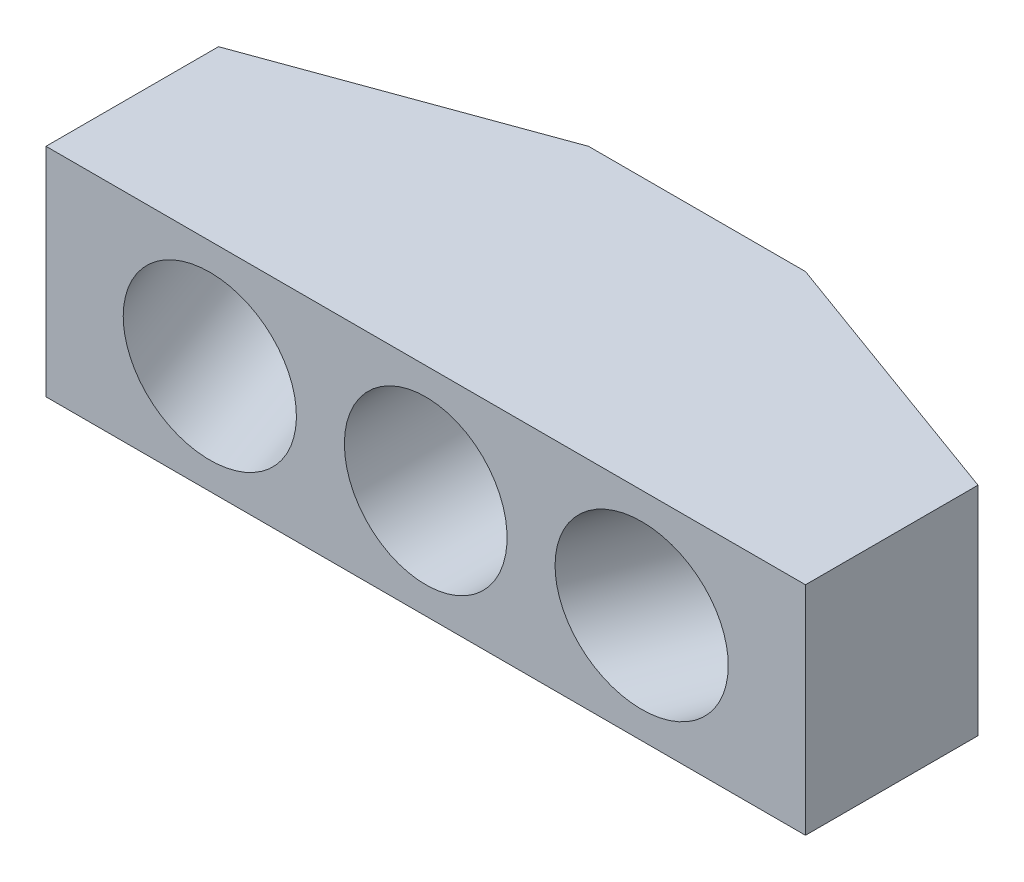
ISO-10303-21;
HEADER;
FILE_DESCRIPTION(('STEP AP214'),'2;1');
FILE_NAME('part.step','',(''),(''),'','','');
FILE_SCHEMA(('AUTOMOTIVE_DESIGN { 1 0 10303 214 1 1 1 1 }'));
ENDSEC;
DATA;
#1=APPLICATION_CONTEXT('core data for automotive mechanical design processes');
#2=APPLICATION_PROTOCOL_DEFINITION('international standard','automotive_design',2000,#1);
#3=PRODUCT_CONTEXT('',#1,'mechanical');
#4=PRODUCT('Part','Part','',(#3));
#5=PRODUCT_RELATED_PRODUCT_CATEGORY('part','',(#4));
#6=PRODUCT_DEFINITION_FORMATION('','',#4);
#7=PRODUCT_DEFINITION_CONTEXT('part definition',#1,'design');
#8=PRODUCT_DEFINITION('design','',#6,#7);
#9=PRODUCT_DEFINITION_SHAPE('','',#8);
#10=(LENGTH_UNIT() NAMED_UNIT(*) SI_UNIT(.MILLI.,.METRE.));
#11=(NAMED_UNIT(*) PLANE_ANGLE_UNIT() SI_UNIT($,.RADIAN.));
#12=(NAMED_UNIT(*) SI_UNIT($,.STERADIAN.) SOLID_ANGLE_UNIT());
#13=UNCERTAINTY_MEASURE_WITH_UNIT(LENGTH_MEASURE(1.E-05),#10,'distance_accuracy_value','');
#14=(GEOMETRIC_REPRESENTATION_CONTEXT(3) GLOBAL_UNCERTAINTY_ASSIGNED_CONTEXT((#13)) GLOBAL_UNIT_ASSIGNED_CONTEXT((#10,
#11,#12)) REPRESENTATION_CONTEXT('',''));
#15=CARTESIAN_POINT('',(0.,0.,0.));
#16=DIRECTION('',(0.,0.,1.));
#17=DIRECTION('',(1.,0.,0.));
#18=AXIS2_PLACEMENT_3D('',#15,#16,#17);
#19=CARTESIAN_POINT('',(4.,4.,-10.));
#20=DIRECTION('',(-0.342020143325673,0.,0.939692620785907));
#21=DIRECTION('',(0.939692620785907,0.,0.342020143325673));
#22=AXIS2_PLACEMENT_3D('',#19,#20,#21);
#23=PLANE('',#22);
#24=CARTESIAN_POINT('',(10.7110758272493,0.,-7.55736815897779));
#25=DIRECTION('',(-0.342020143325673,0.,0.939692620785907));
#26=DIRECTION('',(0.939692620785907,0.,0.342020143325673));
#27=AXIS2_PLACEMENT_3D('',#24,#25,#26);
#28=CIRCLE('',#27,3.22499999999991);
#29=CARTESIAN_POINT('',(13.7415845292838,0.,-6.45435319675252));
#30=VERTEX_POINT('',#29);
#31=EDGE_CURVE('E11',#30,#30,#28,.T.);
#32=ORIENTED_EDGE('',*,*,#31,.T.);
#33=EDGE_LOOP('',(#32));
#34=FACE_BOUND('',#33,.T.);
#35=DIRECTION('',(-0.939692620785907,0.,-0.342020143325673));
#36=VECTOR('',#35,1.);
#37=CARTESIAN_POINT('',(4.,-4.,-10.));
#38=LINE('',#37,#36);
#39=CARTESIAN_POINT('',(14.,-4.,-6.36029765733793));
#40=VERTEX_POINT('',#39);
#41=CARTESIAN_POINT('',(4.,-4.,-10.));
#42=VERTEX_POINT('',#41);
#43=EDGE_CURVE('E97',#40,#42,#38,.T.);
#44=ORIENTED_EDGE('',*,*,#43,.T.);
#45=DIRECTION('',(0.,-1.,0.));
#46=VECTOR('',#45,1.);
#47=CARTESIAN_POINT('',(4.,4.,-10.));
#48=LINE('',#47,#46);
#49=CARTESIAN_POINT('',(4.,4.,-10.));
#50=VERTEX_POINT('',#49);
#51=EDGE_CURVE('E153',#50,#42,#48,.T.);
#52=ORIENTED_EDGE('',*,*,#51,.F.);
#53=DIRECTION('',(-0.939692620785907,0.,-0.342020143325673));
#54=VECTOR('',#53,1.);
#55=CARTESIAN_POINT('',(9.41587104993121,4.,-8.02878414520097));
#56=LINE('',#55,#54);
#57=CARTESIAN_POINT('',(14.,4.,-6.36029765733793));
#58=VERTEX_POINT('',#57);
#59=EDGE_CURVE('E103',#58,#50,#56,.T.);
#60=ORIENTED_EDGE('',*,*,#59,.F.);
#61=DIRECTION('',(0.,-1.,0.));
#62=VECTOR('',#61,1.);
#63=CARTESIAN_POINT('',(14.,4.,-6.36029765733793));
#64=LINE('',#63,#62);
#65=EDGE_CURVE('E131',#58,#40,#64,.T.);
#66=ORIENTED_EDGE('',*,*,#65,.T.);
#67=EDGE_LOOP('',(#44,#52,#60,#66));
#68=FACE_BOUND('',#67,.T.);
#69=ADVANCED_FACE('F49',(#34,#68),#23,.F.);
#70=CARTESIAN_POINT('',(-4.,4.,-10.));
#71=DIRECTION('',(0.,0.,1.));
#72=DIRECTION('',(1.,0.,0.));
#73=AXIS2_PLACEMENT_3D('',#70,#71,#72);
#74=PLANE('',#73);
#75=CARTESIAN_POINT('',(0.,0.,-10.));
#76=DIRECTION('',(0.,0.,1.));
#77=DIRECTION('',(1.,0.,0.));
#78=AXIS2_PLACEMENT_3D('',#75,#76,#77);
#79=CIRCLE('',#78,3.225);
#80=CARTESIAN_POINT('',(3.225,0.,-10.));
#81=VERTEX_POINT('',#80);
#82=EDGE_CURVE('E171',#81,#81,#79,.T.);
#83=ORIENTED_EDGE('',*,*,#82,.T.);
#84=EDGE_LOOP('',(#83));
#85=FACE_BOUND('',#84,.T.);
#86=DIRECTION('',(-1.,0.,0.));
#87=VECTOR('',#86,1.);
#88=CARTESIAN_POINT('',(-4.,-4.,-10.));
#89=LINE('',#88,#87);
#90=CARTESIAN_POINT('',(-4.,-4.,-10.));
#91=VERTEX_POINT('',#90);
#92=EDGE_CURVE('E136',#42,#91,#89,.T.);
#93=ORIENTED_EDGE('',*,*,#92,.T.);
#94=DIRECTION('',(0.,-1.,0.));
#95=VECTOR('',#94,1.);
#96=CARTESIAN_POINT('',(-4.,4.,-10.));
#97=LINE('',#96,#95);
#98=CARTESIAN_POINT('',(-4.,4.,-10.));
#99=VERTEX_POINT('',#98);
#100=EDGE_CURVE('E150',#99,#91,#97,.T.);
#101=ORIENTED_EDGE('',*,*,#100,.F.);
#102=DIRECTION('',(-1.,0.,0.));
#103=VECTOR('',#102,1.);
#104=CARTESIAN_POINT('',(-4.,4.,-10.));
#105=LINE('',#104,#103);
#106=EDGE_CURVE('E236',#50,#99,#105,.T.);
#107=ORIENTED_EDGE('',*,*,#106,.F.);
#108=ORIENTED_EDGE('',*,*,#51,.T.);
#109=EDGE_LOOP('',(#93,#101,#107,#108));
#110=FACE_BOUND('',#109,.T.);
#111=ADVANCED_FACE('F189',(#85,#110),#74,.F.);
#112=CARTESIAN_POINT('',(-9.41587104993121,4.,-8.02878414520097));
#113=DIRECTION('',(0.342020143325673,0.,0.939692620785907));
#114=DIRECTION('',(0.939692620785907,0.,-0.342020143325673));
#115=AXIS2_PLACEMENT_3D('',#112,#113,#114);
#116=PLANE('',#115);
#117=CARTESIAN_POINT('',(-10.7110758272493,0.,-7.55736815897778));
#118=DIRECTION('',(0.342020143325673,0.,0.939692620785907));
#119=DIRECTION('',(0.939692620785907,0.,-0.342020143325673));
#120=AXIS2_PLACEMENT_3D('',#117,#118,#119);
#121=CIRCLE('',#120,3.09319805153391);
#122=CARTESIAN_POINT('',(-7.80442044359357,0.,-8.6153041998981));
#123=VERTEX_POINT('',#122);
#124=EDGE_CURVE('E165',#123,#123,#121,.T.);
#125=ORIENTED_EDGE('',*,*,#124,.T.);
#126=EDGE_LOOP('',(#125));
#127=FACE_BOUND('',#126,.T.);
#128=DIRECTION('',(-0.939692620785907,0.,0.342020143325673));
#129=VECTOR('',#128,1.);
#130=CARTESIAN_POINT('',(-9.41587104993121,-4.,-8.02878414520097));
#131=LINE('',#130,#129);
#132=CARTESIAN_POINT('',(-14.,-4.,-6.36029765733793));
#133=VERTEX_POINT('',#132);
#134=EDGE_CURVE('E140',#91,#133,#131,.T.);
#135=ORIENTED_EDGE('',*,*,#134,.T.);
#136=DIRECTION('',(0.,-1.,0.));
#137=VECTOR('',#136,1.);
#138=CARTESIAN_POINT('',(-14.,4.,-6.36029765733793));
#139=LINE('',#138,#137);
#140=CARTESIAN_POINT('',(-14.,4.,-6.36029765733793));
#141=VERTEX_POINT('',#140);
#142=EDGE_CURVE('E126',#141,#133,#139,.T.);
#143=ORIENTED_EDGE('',*,*,#142,.F.);
#144=DIRECTION('',(-0.939692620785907,0.,0.342020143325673));
#145=VECTOR('',#144,1.);
#146=CARTESIAN_POINT('',(-4.,4.,-10.));
#147=LINE('',#146,#145);
#148=EDGE_CURVE('E117',#99,#141,#147,.T.);
#149=ORIENTED_EDGE('',*,*,#148,.F.);
#150=ORIENTED_EDGE('',*,*,#100,.T.);
#151=EDGE_LOOP('',(#135,#143,#149,#150));
#152=FACE_BOUND('',#151,.T.);
#153=ADVANCED_FACE('F196',(#127,#152),#116,.F.);
#154=CARTESIAN_POINT('',(-14.,4.,0.));
#155=DIRECTION('',(1.,0.,0.));
#156=DIRECTION('',(0.,0.,-1.));
#157=AXIS2_PLACEMENT_3D('',#154,#155,#156);
#158=PLANE('',#157);
#159=DIRECTION('',(0.,0.,1.));
#160=VECTOR('',#159,1.);
#161=CARTESIAN_POINT('',(-14.,-4.,0.));
#162=LINE('',#161,#160);
#163=CARTESIAN_POINT('',(-14.,-4.,0.));
#164=VERTEX_POINT('',#163);
#165=EDGE_CURVE('E125',#133,#164,#162,.T.);
#166=ORIENTED_EDGE('',*,*,#165,.T.);
#167=DIRECTION('',(0.,-1.,0.));
#168=VECTOR('',#167,1.);
#169=CARTESIAN_POINT('',(-14.,4.,0.));
#170=LINE('',#169,#168);
#171=CARTESIAN_POINT('',(-14.,4.,0.));
#172=VERTEX_POINT('',#171);
#173=EDGE_CURVE('E122',#172,#164,#170,.T.);
#174=ORIENTED_EDGE('',*,*,#173,.F.);
#175=DIRECTION('',(0.,0.,1.));
#176=VECTOR('',#175,1.);
#177=CARTESIAN_POINT('',(-14.,4.,0.));
#178=LINE('',#177,#176);
#179=EDGE_CURVE('E111',#141,#172,#178,.T.);
#180=ORIENTED_EDGE('',*,*,#179,.F.);
#181=ORIENTED_EDGE('',*,*,#142,.T.);
#182=EDGE_LOOP('',(#166,#174,#180,#181));
#183=FACE_BOUND('',#182,.T.);
#184=ADVANCED_FACE('F123',(#183),#158,.F.);
#185=CARTESIAN_POINT('',(-14.,4.,0.));
#186=DIRECTION('',(0.,0.,-1.));
#187=DIRECTION('',(-1.,0.,0.));
#188=AXIS2_PLACEMENT_3D('',#185,#186,#187);
#189=PLANE('',#188);
#190=CARTESIAN_POINT('',(-7.96041876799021,0.,0.));
#191=DIRECTION('',(0.,0.,-1.));
#192=DIRECTION('',(-1.,0.,0.));
#193=AXIS2_PLACEMENT_3D('',#190,#191,#192);
#194=ELLIPSE('',#193,3.19253331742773,2.99999999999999);
#195=CARTESIAN_POINT('',(-11.1529520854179,0.,0.));
#196=VERTEX_POINT('',#195);
#197=EDGE_CURVE('E160',#196,#196,#194,.T.);
#198=ORIENTED_EDGE('',*,*,#197,.T.);
#199=EDGE_LOOP('',(#198));
#200=FACE_BOUND('',#199,.T.);
#201=CARTESIAN_POINT('',(7.96041876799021,0.,0.));
#202=DIRECTION('',(0.,0.,-1.));
#203=DIRECTION('',(1.,0.,0.));
#204=AXIS2_PLACEMENT_3D('',#201,#202,#203);
#205=ELLIPSE('',#204,3.19253331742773,2.99999999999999);
#206=CARTESIAN_POINT('',(11.1529520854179,0.,0.));
#207=VERTEX_POINT('',#206);
#208=EDGE_CURVE('E157',#207,#207,#205,.T.);
#209=ORIENTED_EDGE('',*,*,#208,.T.);
#210=EDGE_LOOP('',(#209));
#211=FACE_BOUND('',#210,.T.);
#212=CARTESIAN_POINT('',(0.,0.,0.));
#213=DIRECTION('',(0.,0.,-1.));
#214=DIRECTION('',(-1.,0.,0.));
#215=AXIS2_PLACEMENT_3D('',#212,#213,#214);
#216=CIRCLE('',#215,3.);
#217=CARTESIAN_POINT('',(-3.,0.,0.));
#218=VERTEX_POINT('',#217);
#219=EDGE_CURVE('E137',#218,#218,#216,.T.);
#220=ORIENTED_EDGE('',*,*,#219,.T.);
#221=EDGE_LOOP('',(#220));
#222=FACE_BOUND('',#221,.T.);
#223=DIRECTION('',(1.,0.,0.));
#224=VECTOR('',#223,1.);
#225=CARTESIAN_POINT('',(-14.,-4.,0.));
#226=LINE('',#225,#224);
#227=CARTESIAN_POINT('',(14.,-4.,0.));
#228=VERTEX_POINT('',#227);
#229=EDGE_CURVE('E90',#164,#228,#226,.T.);
#230=ORIENTED_EDGE('',*,*,#229,.T.);
#231=DIRECTION('',(0.,-1.,0.));
#232=VECTOR('',#231,1.);
#233=CARTESIAN_POINT('',(14.,4.,0.));
#234=LINE('',#233,#232);
#235=CARTESIAN_POINT('',(14.,4.,0.));
#236=VERTEX_POINT('',#235);
#237=EDGE_CURVE('E127',#236,#228,#234,.T.);
#238=ORIENTED_EDGE('',*,*,#237,.F.);
#239=DIRECTION('',(1.,0.,0.));
#240=VECTOR('',#239,1.);
#241=CARTESIAN_POINT('',(-14.,4.,0.));
#242=LINE('',#241,#240);
#243=EDGE_CURVE('E115',#172,#236,#242,.T.);
#244=ORIENTED_EDGE('',*,*,#243,.F.);
#245=ORIENTED_EDGE('',*,*,#173,.T.);
#246=EDGE_LOOP('',(#230,#238,#244,#245));
#247=FACE_BOUND('',#246,.T.);
#248=ADVANCED_FACE('F129',(#200,#211,#222,#247),#189,.F.);
#249=CARTESIAN_POINT('',(14.,4.,0.));
#250=DIRECTION('',(-1.,0.,0.));
#251=DIRECTION('',(0.,0.,1.));
#252=AXIS2_PLACEMENT_3D('',#249,#250,#251);
#253=PLANE('',#252);
#254=DIRECTION('',(0.,0.,-1.));
#255=VECTOR('',#254,1.);
#256=CARTESIAN_POINT('',(14.,-4.,0.));
#257=LINE('',#256,#255);
#258=EDGE_CURVE('E144',#228,#40,#257,.T.);
#259=ORIENTED_EDGE('',*,*,#258,.T.);
#260=ORIENTED_EDGE('',*,*,#65,.F.);
#261=DIRECTION('',(0.,0.,-1.));
#262=VECTOR('',#261,1.);
#263=CARTESIAN_POINT('',(14.,4.,0.));
#264=LINE('',#263,#262);
#265=EDGE_CURVE('E67',#236,#58,#264,.T.);
#266=ORIENTED_EDGE('',*,*,#265,.F.);
#267=ORIENTED_EDGE('',*,*,#237,.T.);
#268=EDGE_LOOP('',(#259,#260,#266,#267));
#269=FACE_BOUND('',#268,.T.);
#270=ADVANCED_FACE('F226',(#269),#253,.F.);
#271=CARTESIAN_POINT('',(0.,4.,0.));
#272=DIRECTION('',(0.,1.,0.));
#273=DIRECTION('',(0.,0.,1.));
#274=AXIS2_PLACEMENT_3D('',#271,#272,#273);
#275=PLANE('',#274);
#276=ORIENTED_EDGE('',*,*,#59,.T.);
#277=ORIENTED_EDGE('',*,*,#106,.T.);
#278=ORIENTED_EDGE('',*,*,#148,.T.);
#279=ORIENTED_EDGE('',*,*,#179,.T.);
#280=ORIENTED_EDGE('',*,*,#243,.T.);
#281=ORIENTED_EDGE('',*,*,#265,.T.);
#282=EDGE_LOOP('',(#276,#277,#278,#279,#280,#281));
#283=FACE_BOUND('',#282,.T.);
#284=ADVANCED_FACE('F113',(#283),#275,.T.);
#285=CARTESIAN_POINT('',(0.,-4.,0.));
#286=DIRECTION('',(0.,1.,0.));
#287=DIRECTION('',(0.,0.,1.));
#288=AXIS2_PLACEMENT_3D('',#285,#286,#287);
#289=PLANE('',#288);
#290=ORIENTED_EDGE('',*,*,#43,.F.);
#291=ORIENTED_EDGE('',*,*,#258,.F.);
#292=ORIENTED_EDGE('',*,*,#229,.F.);
#293=ORIENTED_EDGE('',*,*,#165,.F.);
#294=ORIENTED_EDGE('',*,*,#134,.F.);
#295=ORIENTED_EDGE('',*,*,#92,.F.);
#296=EDGE_LOOP('',(#290,#291,#292,#293,#294,#295));
#297=FACE_BOUND('',#296,.T.);
#298=ADVANCED_FACE('F241',(#297),#289,.F.);
#299=CARTESIAN_POINT('',(0.,0.,-10.));
#300=DIRECTION('',(0.,0.,-1.));
#301=DIRECTION('',(-1.,0.,0.));
#302=AXIS2_PLACEMENT_3D('',#299,#300,#301);
#303=CYLINDRICAL_SURFACE('',#302,3.);
#304=CARTESIAN_POINT('',(0.,0.,-9.90680194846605));
#305=DIRECTION('',(0.,0.,-1.));
#306=DIRECTION('',(-1.,0.,0.));
#307=AXIS2_PLACEMENT_3D('',#304,#305,#306);
#308=CIRCLE('',#307,3.);
#309=CARTESIAN_POINT('',(-3.,0.,-9.90680194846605));
#310=VERTEX_POINT('',#309);
#311=EDGE_CURVE('E168',#310,#310,#308,.T.);
#312=ORIENTED_EDGE('',*,*,#311,.T.);
#313=EDGE_LOOP('',(#312));
#314=FACE_BOUND('',#313,.T.);
#315=ORIENTED_EDGE('',*,*,#219,.F.);
#316=EDGE_LOOP('',(#315));
#317=FACE_BOUND('',#316,.T.);
#318=ADVANCED_FACE('F263',(#314,#317),#303,.F.);
#319=CARTESIAN_POINT('',(10.7110758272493,0.,-7.55736815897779));
#320=DIRECTION('',(0.342020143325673,0.,-0.939692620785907));
#321=DIRECTION('',(-0.939692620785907,0.,-0.342020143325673));
#322=AXIS2_PLACEMENT_3D('',#319,#320,#321);
#323=CYLINDRICAL_SURFACE('',#322,2.99999999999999);
#324=CARTESIAN_POINT('',(10.679200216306,0.,-7.46979063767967));
#325=DIRECTION('',(0.342020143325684,0.,-0.939692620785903));
#326=DIRECTION('',(-0.939692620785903,0.,-0.342020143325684));
#327=AXIS2_PLACEMENT_3D('',#324,#325,#326);
#328=CIRCLE('',#327,2.99999999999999);
#329=CARTESIAN_POINT('',(7.8601223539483,0.,-8.49585106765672));
#330=VERTEX_POINT('',#329);
#331=EDGE_CURVE('E59',#330,#330,#328,.T.);
#332=ORIENTED_EDGE('',*,*,#331,.T.);
#333=EDGE_LOOP('',(#332));
#334=FACE_BOUND('',#333,.T.);
#335=ORIENTED_EDGE('',*,*,#208,.F.);
#336=EDGE_LOOP('',(#335));
#337=FACE_BOUND('',#336,.T.);
#338=ADVANCED_FACE('F176',(#334,#337),#323,.F.);
#339=CARTESIAN_POINT('',(-10.7110758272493,0.,-7.55736815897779));
#340=DIRECTION('',(-0.342020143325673,0.,-0.939692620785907));
#341=DIRECTION('',(-0.939692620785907,0.,0.342020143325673));
#342=AXIS2_PLACEMENT_3D('',#339,#340,#341);
#343=CYLINDRICAL_SURFACE('',#342,2.99999999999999);
#344=CARTESIAN_POINT('',(-10.634121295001,0.,-7.34593731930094));
#345=DIRECTION('',(0.342020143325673,0.,0.939692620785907));
#346=DIRECTION('',(0.939692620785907,0.,-0.342020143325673));
#347=AXIS2_PLACEMENT_3D('',#344,#345,#346);
#348=CIRCLE('',#347,2.99999999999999);
#349=CARTESIAN_POINT('',(-7.81504343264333,0.,-8.37199774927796));
#350=VERTEX_POINT('',#349);
#351=EDGE_CURVE('E156',#350,#350,#348,.F.);
#352=ORIENTED_EDGE('',*,*,#351,.T.);
#353=EDGE_LOOP('',(#352));
#354=FACE_BOUND('',#353,.T.);
#355=ORIENTED_EDGE('',*,*,#197,.F.);
#356=EDGE_LOOP('',(#355));
#357=FACE_BOUND('',#356,.T.);
#358=ADVANCED_FACE('F207',(#354,#357),#343,.F.);
#359=CARTESIAN_POINT('',(-10.634121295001,0.,-7.34593731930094));
#360=DIRECTION('',(-0.342020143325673,0.,-0.939692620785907));
#361=DIRECTION('',(-0.939692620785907,0.,0.342020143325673));
#362=AXIS2_PLACEMENT_3D('',#359,#360,#361);
#363=CONICAL_SURFACE('',#362,2.99999999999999,0.392699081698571);
#364=ORIENTED_EDGE('',*,*,#124,.F.);
#365=EDGE_LOOP('',(#364));
#366=FACE_BOUND('',#365,.T.);
#367=ORIENTED_EDGE('',*,*,#351,.F.);
#368=EDGE_LOOP('',(#367));
#369=FACE_BOUND('',#368,.T.);
#370=ADVANCED_FACE('F185',(#366,#369),#363,.F.);
#371=CARTESIAN_POINT('',(0.,0.,-9.85857864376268));
#372=DIRECTION('',(0.,0.,-1.));
#373=DIRECTION('',(-1.,0.,0.));
#374=AXIS2_PLACEMENT_3D('',#371,#372,#373);
#375=CONICAL_SURFACE('',#374,2.88357864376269,1.17809724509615);
#376=ORIENTED_EDGE('',*,*,#82,.F.);
#377=EDGE_LOOP('',(#376));
#378=FACE_BOUND('',#377,.T.);
#379=ORIENTED_EDGE('',*,*,#311,.F.);
#380=EDGE_LOOP('',(#379));
#381=FACE_BOUND('',#380,.T.);
#382=ADVANCED_FACE('F180',(#378,#381),#375,.F.);
#383=CARTESIAN_POINT('',(10.6627068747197,0.,-7.42447555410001));
#384=DIRECTION('',(0.342020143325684,0.,-0.939692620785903));
#385=DIRECTION('',(-0.939692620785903,0.,-0.342020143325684));
#386=AXIS2_PLACEMENT_3D('',#383,#384,#385);
#387=CONICAL_SURFACE('',#386,2.88357864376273,1.17809724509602);
#388=ORIENTED_EDGE('',*,*,#31,.F.);
#389=EDGE_LOOP('',(#388));
#390=FACE_BOUND('',#389,.T.);
#391=ORIENTED_EDGE('',*,*,#331,.F.);
#392=EDGE_LOOP('',(#391));
#393=FACE_BOUND('',#392,.T.);
#394=ADVANCED_FACE('F52',(#390,#393),#387,.F.);
#395=CLOSED_SHELL('',(#69,#111,#153,#184,#248,#270,#284,#298,#318,#338,#358,#370,#382,#394));
#396=MANIFOLD_SOLID_BREP('B2',#395);
#397=ADVANCED_BREP_SHAPE_REPRESENTATION('',(#18,#396),#14);
#398=SHAPE_DEFINITION_REPRESENTATION(#9,#397);
ENDSEC;
END-ISO-10303-21;
